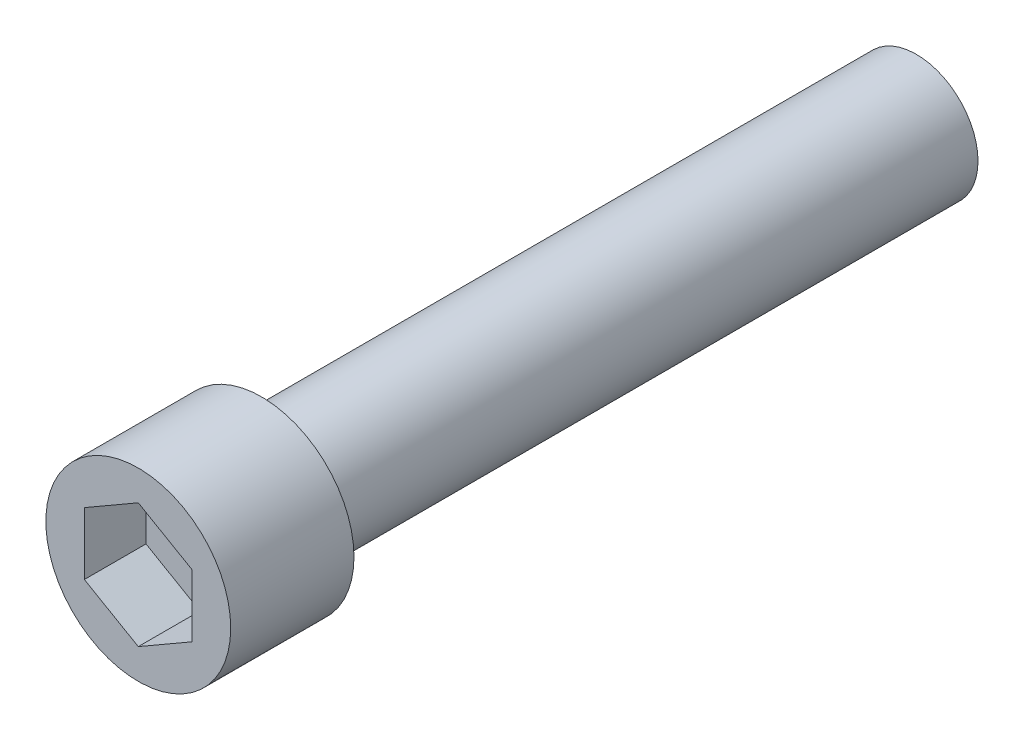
ISO-10303-21;
HEADER;
FILE_DESCRIPTION(('STEP AP214'),'2;1');
FILE_NAME('part.step','',(''),(''),'','','');
FILE_SCHEMA(('AUTOMOTIVE_DESIGN { 1 0 10303 214 1 1 1 1 }'));
ENDSEC;
DATA;
#1=APPLICATION_CONTEXT('core data for automotive mechanical design processes');
#2=APPLICATION_PROTOCOL_DEFINITION('international standard','automotive_design',2000,#1);
#3=PRODUCT_CONTEXT('',#1,'mechanical');
#4=PRODUCT('Part','Part','',(#3));
#5=PRODUCT_RELATED_PRODUCT_CATEGORY('part','',(#4));
#6=PRODUCT_DEFINITION_FORMATION('','',#4);
#7=PRODUCT_DEFINITION_CONTEXT('part definition',#1,'design');
#8=PRODUCT_DEFINITION('design','',#6,#7);
#9=PRODUCT_DEFINITION_SHAPE('','',#8);
#10=(LENGTH_UNIT() NAMED_UNIT(*) SI_UNIT(.MILLI.,.METRE.));
#11=(NAMED_UNIT(*) PLANE_ANGLE_UNIT() SI_UNIT($,.RADIAN.));
#12=(NAMED_UNIT(*) SI_UNIT($,.STERADIAN.) SOLID_ANGLE_UNIT());
#13=UNCERTAINTY_MEASURE_WITH_UNIT(LENGTH_MEASURE(1.E-05),#10,'distance_accuracy_value','');
#14=(GEOMETRIC_REPRESENTATION_CONTEXT(3) GLOBAL_UNCERTAINTY_ASSIGNED_CONTEXT((#13)) GLOBAL_UNIT_ASSIGNED_CONTEXT((#10,
#11,#12)) REPRESENTATION_CONTEXT('',''));
#15=CARTESIAN_POINT('',(0.,0.,0.));
#16=DIRECTION('',(0.,0.,1.));
#17=DIRECTION('',(1.,0.,0.));
#18=AXIS2_PLACEMENT_3D('',#15,#16,#17);
#19=CARTESIAN_POINT('',(0.,8.08290376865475,8.));
#20=DIRECTION('',(-0.5,-0.86602540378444,0.));
#21=DIRECTION('',(0.86602540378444,-0.5,0.));
#22=AXIS2_PLACEMENT_3D('',#19,#20,#21);
#23=PLANE('',#22);
#24=DIRECTION('',(0.,0.,1.));
#25=VECTOR('',#24,1.);
#26=CARTESIAN_POINT('',(7.,4.04145188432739,8.));
#27=LINE('',#26,#25);
#28=CARTESIAN_POINT('',(7.,4.04145188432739,8.));
#29=VERTEX_POINT('',#28);
#30=CARTESIAN_POINT('',(7.,4.04145188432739,16.));
#31=VERTEX_POINT('',#30);
#32=EDGE_CURVE('E63',#29,#31,#27,.T.);
#33=ORIENTED_EDGE('',*,*,#32,.T.);
#34=DIRECTION('',(0.86602540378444,-0.5,0.));
#35=VECTOR('',#34,1.);
#36=CARTESIAN_POINT('',(0.,8.08290376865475,16.));
#37=LINE('',#36,#35);
#38=CARTESIAN_POINT('',(0.,8.08290376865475,16.));
#39=VERTEX_POINT('',#38);
#40=EDGE_CURVE('E29',#39,#31,#37,.T.);
#41=ORIENTED_EDGE('',*,*,#40,.F.);
#42=DIRECTION('',(0.,0.,1.));
#43=VECTOR('',#42,1.);
#44=CARTESIAN_POINT('',(0.,8.08290376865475,8.));
#45=LINE('',#44,#43);
#46=CARTESIAN_POINT('',(0.,8.08290376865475,8.));
#47=VERTEX_POINT('',#46);
#48=EDGE_CURVE('E33',#47,#39,#45,.T.);
#49=ORIENTED_EDGE('',*,*,#48,.F.);
#50=DIRECTION('',(0.86602540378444,-0.5,0.));
#51=VECTOR('',#50,1.);
#52=CARTESIAN_POINT('',(0.,8.08290376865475,8.));
#53=LINE('',#52,#51);
#54=EDGE_CURVE('E65',#47,#29,#53,.T.);
#55=ORIENTED_EDGE('',*,*,#54,.T.);
#56=EDGE_LOOP('',(#33,#41,#49,#55));
#57=FACE_BOUND('',#56,.T.);
#58=ADVANCED_FACE('F14',(#57),#23,.T.);
#59=CARTESIAN_POINT('',(7.,-4.04145188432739,8.));
#60=DIRECTION('',(1.,0.,0.));
#61=DIRECTION('',(0.,1.,0.));
#62=AXIS2_PLACEMENT_3D('',#59,#60,#61);
#63=PLANE('',#62);
#64=DIRECTION('',(0.,0.,1.));
#65=VECTOR('',#64,1.);
#66=CARTESIAN_POINT('',(7.,-4.04145188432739,8.));
#67=LINE('',#66,#65);
#68=CARTESIAN_POINT('',(7.,-4.04145188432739,8.));
#69=VERTEX_POINT('',#68);
#70=CARTESIAN_POINT('',(7.,-4.04145188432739,16.));
#71=VERTEX_POINT('',#70);
#72=EDGE_CURVE('E70',#69,#71,#67,.T.);
#73=ORIENTED_EDGE('',*,*,#72,.T.);
#74=DIRECTION('',(0.,1.,0.));
#75=VECTOR('',#74,1.);
#76=CARTESIAN_POINT('',(7.,-4.04145188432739,16.));
#77=LINE('',#76,#75);
#78=EDGE_CURVE('E73',#71,#31,#77,.T.);
#79=ORIENTED_EDGE('',*,*,#78,.T.);
#80=ORIENTED_EDGE('',*,*,#32,.F.);
#81=DIRECTION('',(0.,1.,0.));
#82=VECTOR('',#81,1.);
#83=CARTESIAN_POINT('',(7.,-4.04145188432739,8.));
#84=LINE('',#83,#82);
#85=EDGE_CURVE('E99',#69,#29,#84,.T.);
#86=ORIENTED_EDGE('',*,*,#85,.F.);
#87=EDGE_LOOP('',(#73,#79,#80,#86));
#88=FACE_BOUND('',#87,.T.);
#89=ADVANCED_FACE('F74',(#88),#63,.F.);
#90=CARTESIAN_POINT('',(0.,-8.08290376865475,8.));
#91=DIRECTION('',(0.5,-0.86602540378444,0.));
#92=DIRECTION('',(0.86602540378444,0.5,0.));
#93=AXIS2_PLACEMENT_3D('',#90,#91,#92);
#94=PLANE('',#93);
#95=DIRECTION('',(0.,0.,1.));
#96=VECTOR('',#95,1.);
#97=CARTESIAN_POINT('',(0.,-8.08290376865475,8.));
#98=LINE('',#97,#96);
#99=CARTESIAN_POINT('',(0.,-8.08290376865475,8.));
#100=VERTEX_POINT('',#99);
#101=CARTESIAN_POINT('',(0.,-8.08290376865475,16.));
#102=VERTEX_POINT('',#101);
#103=EDGE_CURVE('E107',#100,#102,#98,.T.);
#104=ORIENTED_EDGE('',*,*,#103,.T.);
#105=DIRECTION('',(0.86602540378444,0.5,0.));
#106=VECTOR('',#105,1.);
#107=CARTESIAN_POINT('',(0.,-8.08290376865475,16.));
#108=LINE('',#107,#106);
#109=EDGE_CURVE('E78',#102,#71,#108,.T.);
#110=ORIENTED_EDGE('',*,*,#109,.T.);
#111=ORIENTED_EDGE('',*,*,#72,.F.);
#112=DIRECTION('',(0.86602540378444,0.5,0.));
#113=VECTOR('',#112,1.);
#114=CARTESIAN_POINT('',(0.,-8.08290376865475,8.));
#115=LINE('',#114,#113);
#116=EDGE_CURVE('E96',#100,#69,#115,.T.);
#117=ORIENTED_EDGE('',*,*,#116,.F.);
#118=EDGE_LOOP('',(#104,#110,#111,#117));
#119=FACE_BOUND('',#118,.T.);
#120=ADVANCED_FACE('F140',(#119),#94,.F.);
#121=CARTESIAN_POINT('',(0.,-8.08290376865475,8.));
#122=DIRECTION('',(0.5,0.86602540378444,0.));
#123=DIRECTION('',(-0.86602540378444,0.5,0.));
#124=AXIS2_PLACEMENT_3D('',#121,#122,#123);
#125=PLANE('',#124);
#126=DIRECTION('',(0.,0.,1.));
#127=VECTOR('',#126,1.);
#128=CARTESIAN_POINT('',(-7.,-4.04145188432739,8.));
#129=LINE('',#128,#127);
#130=CARTESIAN_POINT('',(-7.,-4.04145188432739,8.));
#131=VERTEX_POINT('',#130);
#132=CARTESIAN_POINT('',(-7.,-4.04145188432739,16.));
#133=VERTEX_POINT('',#132);
#134=EDGE_CURVE('E105',#131,#133,#129,.T.);
#135=ORIENTED_EDGE('',*,*,#134,.T.);
#136=DIRECTION('',(-0.86602540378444,0.5,0.));
#137=VECTOR('',#136,1.);
#138=CARTESIAN_POINT('',(0.,-8.08290376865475,16.));
#139=LINE('',#138,#137);
#140=EDGE_CURVE('E248',#102,#133,#139,.T.);
#141=ORIENTED_EDGE('',*,*,#140,.F.);
#142=ORIENTED_EDGE('',*,*,#103,.F.);
#143=DIRECTION('',(-0.86602540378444,0.5,0.));
#144=VECTOR('',#143,1.);
#145=CARTESIAN_POINT('',(0.,-8.08290376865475,8.));
#146=LINE('',#145,#144);
#147=EDGE_CURVE('E93',#100,#131,#146,.T.);
#148=ORIENTED_EDGE('',*,*,#147,.T.);
#149=EDGE_LOOP('',(#135,#141,#142,#148));
#150=FACE_BOUND('',#149,.T.);
#151=ADVANCED_FACE('F152',(#150),#125,.T.);
#152=CARTESIAN_POINT('',(-7.,4.04145188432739,8.));
#153=DIRECTION('',(-1.,0.,0.));
#154=DIRECTION('',(0.,-1.,0.));
#155=AXIS2_PLACEMENT_3D('',#152,#153,#154);
#156=PLANE('',#155);
#157=DIRECTION('',(0.,0.,1.));
#158=VECTOR('',#157,1.);
#159=CARTESIAN_POINT('',(-7.,4.04145188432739,8.));
#160=LINE('',#159,#158);
#161=CARTESIAN_POINT('',(-7.,4.04145188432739,8.));
#162=VERTEX_POINT('',#161);
#163=CARTESIAN_POINT('',(-7.,4.04145188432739,16.));
#164=VERTEX_POINT('',#163);
#165=EDGE_CURVE('E103',#162,#164,#160,.T.);
#166=ORIENTED_EDGE('',*,*,#165,.T.);
#167=DIRECTION('',(0.,-1.,0.));
#168=VECTOR('',#167,1.);
#169=CARTESIAN_POINT('',(-7.,4.04145188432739,16.));
#170=LINE('',#169,#168);
#171=EDGE_CURVE('E249',#164,#133,#170,.T.);
#172=ORIENTED_EDGE('',*,*,#171,.T.);
#173=ORIENTED_EDGE('',*,*,#134,.F.);
#174=DIRECTION('',(0.,-1.,0.));
#175=VECTOR('',#174,1.);
#176=CARTESIAN_POINT('',(-7.,4.04145188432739,8.));
#177=LINE('',#176,#175);
#178=EDGE_CURVE('E90',#162,#131,#177,.T.);
#179=ORIENTED_EDGE('',*,*,#178,.F.);
#180=EDGE_LOOP('',(#166,#172,#173,#179));
#181=FACE_BOUND('',#180,.T.);
#182=ADVANCED_FACE('F148',(#181),#156,.F.);
#183=CARTESIAN_POINT('',(0.,8.08290376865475,8.));
#184=DIRECTION('',(-0.5,0.86602540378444,0.));
#185=DIRECTION('',(-0.86602540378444,-0.5,0.));
#186=AXIS2_PLACEMENT_3D('',#183,#184,#185);
#187=PLANE('',#186);
#188=DIRECTION('',(-0.86602540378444,-0.5,0.));
#189=VECTOR('',#188,1.);
#190=CARTESIAN_POINT('',(0.,8.08290376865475,8.));
#191=LINE('',#190,#189);
#192=EDGE_CURVE('E87',#47,#162,#191,.T.);
#193=ORIENTED_EDGE('',*,*,#192,.F.);
#194=ORIENTED_EDGE('',*,*,#48,.T.);
#195=DIRECTION('',(-0.86602540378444,-0.5,0.));
#196=VECTOR('',#195,1.);
#197=CARTESIAN_POINT('',(0.,8.08290376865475,16.));
#198=LINE('',#197,#196);
#199=EDGE_CURVE('E83',#39,#164,#198,.T.);
#200=ORIENTED_EDGE('',*,*,#199,.T.);
#201=ORIENTED_EDGE('',*,*,#165,.F.);
#202=EDGE_LOOP('',(#193,#194,#200,#201));
#203=FACE_BOUND('',#202,.T.);
#204=ADVANCED_FACE('F145',(#203),#187,.F.);
#205=CARTESIAN_POINT('',(-7.,12.1243556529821,8.));
#206=DIRECTION('',(0.,0.,-1.));
#207=DIRECTION('',(-1.,0.,0.));
#208=AXIS2_PLACEMENT_3D('',#205,#206,#207);
#209=PLANE('',#208);
#210=ORIENTED_EDGE('',*,*,#54,.F.);
#211=ORIENTED_EDGE('',*,*,#192,.T.);
#212=ORIENTED_EDGE('',*,*,#178,.T.);
#213=ORIENTED_EDGE('',*,*,#147,.F.);
#214=ORIENTED_EDGE('',*,*,#116,.T.);
#215=ORIENTED_EDGE('',*,*,#85,.T.);
#216=EDGE_LOOP('',(#210,#211,#212,#213,#214,#215));
#217=FACE_BOUND('',#216,.T.);
#218=ADVANCED_FACE('F144',(#217),#209,.F.);
#219=CARTESIAN_POINT('',(0.,0.,16.));
#220=DIRECTION('',(0.,0.,1.));
#221=DIRECTION('',(1.,0.,0.));
#222=AXIS2_PLACEMENT_3D('',#219,#220,#221);
#223=PLANE('',#222);
#224=CARTESIAN_POINT('',(0.,0.,16.));
#225=DIRECTION('',(0.,0.,1.));
#226=DIRECTION('',(1.,0.,0.));
#227=AXIS2_PLACEMENT_3D('',#224,#225,#226);
#228=CIRCLE('',#227,12.);
#229=CARTESIAN_POINT('',(12.,0.,16.));
#230=VERTEX_POINT('',#229);
#231=EDGE_CURVE('E9',#230,#230,#228,.T.);
#232=ORIENTED_EDGE('',*,*,#231,.T.);
#233=EDGE_LOOP('',(#232));
#234=FACE_BOUND('',#233,.T.);
#235=ORIENTED_EDGE('',*,*,#199,.F.);
#236=ORIENTED_EDGE('',*,*,#40,.T.);
#237=ORIENTED_EDGE('',*,*,#78,.F.);
#238=ORIENTED_EDGE('',*,*,#109,.F.);
#239=ORIENTED_EDGE('',*,*,#140,.T.);
#240=ORIENTED_EDGE('',*,*,#171,.F.);
#241=EDGE_LOOP('',(#235,#236,#237,#238,#239,#240));
#242=FACE_BOUND('',#241,.T.);
#243=ADVANCED_FACE('F16',(#234,#242),#223,.T.);
#244=CARTESIAN_POINT('',(0.,0.,-65.));
#245=DIRECTION('',(0.,0.,1.));
#246=DIRECTION('',(1.,0.,0.));
#247=AXIS2_PLACEMENT_3D('',#244,#245,#246);
#248=CYLINDRICAL_SURFACE('',#247,12.);
#249=CARTESIAN_POINT('',(0.,0.,0.));
#250=DIRECTION('',(0.,0.,1.));
#251=DIRECTION('',(1.,0.,0.));
#252=AXIS2_PLACEMENT_3D('',#249,#250,#251);
#253=CIRCLE('',#252,12.);
#254=CARTESIAN_POINT('',(12.,0.,0.));
#255=VERTEX_POINT('',#254);
#256=EDGE_CURVE('E22',#255,#255,#253,.T.);
#257=ORIENTED_EDGE('',*,*,#256,.T.);
#258=EDGE_LOOP('',(#257));
#259=FACE_BOUND('',#258,.T.);
#260=ORIENTED_EDGE('',*,*,#231,.F.);
#261=EDGE_LOOP('',(#260));
#262=FACE_BOUND('',#261,.T.);
#263=ADVANCED_FACE('F117',(#259,#262),#248,.T.);
#264=CARTESIAN_POINT('',(12.,0.,0.));
#265=DIRECTION('',(0.,0.,-1.));
#266=DIRECTION('',(-1.,0.,0.));
#267=AXIS2_PLACEMENT_3D('',#264,#265,#266);
#268=PLANE('',#267);
#269=CARTESIAN_POINT('',(0.,0.,0.));
#270=DIRECTION('',(0.,0.,1.));
#271=DIRECTION('',(1.,0.,0.));
#272=AXIS2_PLACEMENT_3D('',#269,#270,#271);
#273=CIRCLE('',#272,8.);
#274=CARTESIAN_POINT('',(8.,0.,0.));
#275=VERTEX_POINT('',#274);
#276=EDGE_CURVE('E112',#275,#275,#273,.T.);
#277=ORIENTED_EDGE('',*,*,#276,.T.);
#278=EDGE_LOOP('',(#277));
#279=FACE_BOUND('',#278,.T.);
#280=ORIENTED_EDGE('',*,*,#256,.F.);
#281=EDGE_LOOP('',(#280));
#282=FACE_BOUND('',#281,.T.);
#283=ADVANCED_FACE('F120',(#279,#282),#268,.T.);
#284=CARTESIAN_POINT('',(0.,0.,-65.));
#285=DIRECTION('',(0.,0.,1.));
#286=DIRECTION('',(1.,0.,0.));
#287=AXIS2_PLACEMENT_3D('',#284,#285,#286);
#288=CYLINDRICAL_SURFACE('',#287,8.);
#289=CARTESIAN_POINT('',(0.,0.,-85.));
#290=DIRECTION('',(0.,0.,1.));
#291=DIRECTION('',(1.,0.,0.));
#292=AXIS2_PLACEMENT_3D('',#289,#290,#291);
#293=CIRCLE('',#292,8.);
#294=CARTESIAN_POINT('',(8.,0.,-85.));
#295=VERTEX_POINT('',#294);
#296=EDGE_CURVE('E69',#295,#295,#293,.T.);
#297=ORIENTED_EDGE('',*,*,#296,.T.);
#298=EDGE_LOOP('',(#297));
#299=FACE_BOUND('',#298,.T.);
#300=ORIENTED_EDGE('',*,*,#276,.F.);
#301=EDGE_LOOP('',(#300));
#302=FACE_BOUND('',#301,.T.);
#303=ADVANCED_FACE('F122',(#299,#302),#288,.T.);
#304=CARTESIAN_POINT('',(8.,0.,-85.));
#305=DIRECTION('',(0.,0.,-1.));
#306=DIRECTION('',(-1.,0.,0.));
#307=AXIS2_PLACEMENT_3D('',#304,#305,#306);
#308=PLANE('',#307);
#309=ORIENTED_EDGE('',*,*,#296,.F.);
#310=EDGE_LOOP('',(#309));
#311=FACE_BOUND('',#310,.T.);
#312=ADVANCED_FACE('F131',(#311),#308,.T.);
#313=CLOSED_SHELL('',(#58,#89,#120,#151,#182,#204,#218,#243,#263,#283,#303,#312));
#314=MANIFOLD_SOLID_BREP('B1',#313);
#315=ADVANCED_BREP_SHAPE_REPRESENTATION('',(#18,#314),#14);
#316=SHAPE_DEFINITION_REPRESENTATION(#9,#315);
ENDSEC;
END-ISO-10303-21;
